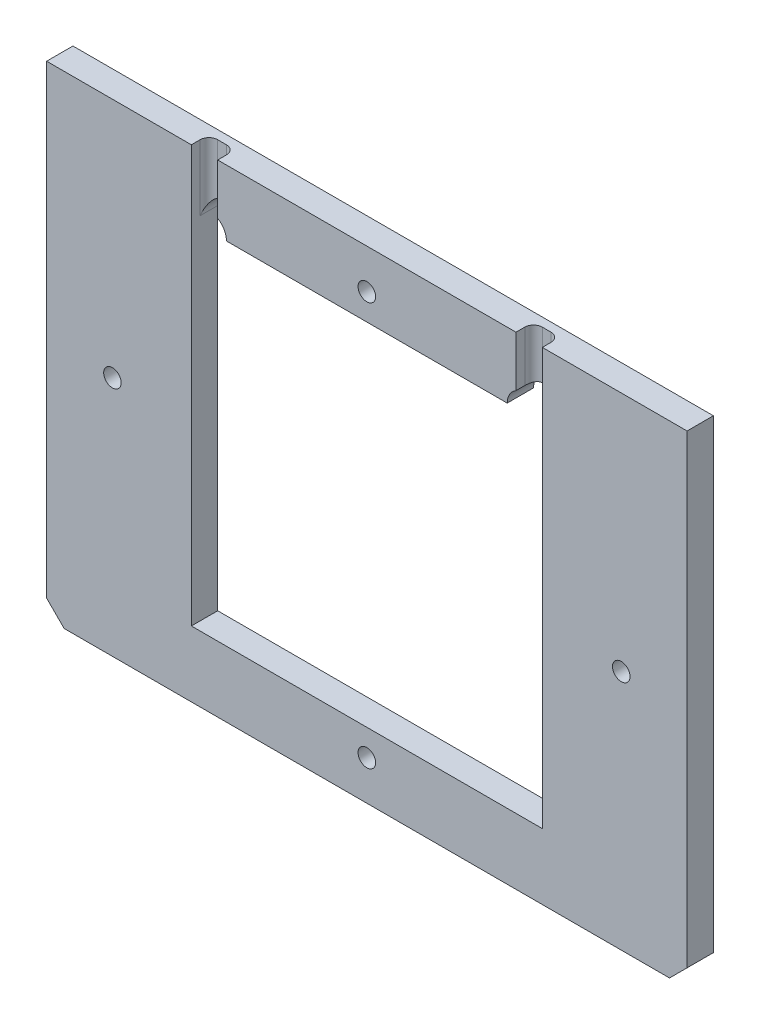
ISO-10303-21;
HEADER;
FILE_DESCRIPTION(('STEP AP214'),'2;1');
FILE_NAME('part.step','',(''),(''),'','','');
FILE_SCHEMA(('AUTOMOTIVE_DESIGN { 1 0 10303 214 1 1 1 1 }'));
ENDSEC;
DATA;
#1=APPLICATION_CONTEXT('core data for automotive mechanical design processes');
#2=APPLICATION_PROTOCOL_DEFINITION('international standard','automotive_design',2000,#1);
#3=PRODUCT_CONTEXT('',#1,'mechanical');
#4=PRODUCT('Part','Part','',(#3));
#5=PRODUCT_RELATED_PRODUCT_CATEGORY('part','',(#4));
#6=PRODUCT_DEFINITION_FORMATION('','',#4);
#7=PRODUCT_DEFINITION_CONTEXT('part definition',#1,'design');
#8=PRODUCT_DEFINITION('design','',#6,#7);
#9=PRODUCT_DEFINITION_SHAPE('','',#8);
#10=(LENGTH_UNIT() NAMED_UNIT(*) SI_UNIT(.MILLI.,.METRE.));
#11=(NAMED_UNIT(*) PLANE_ANGLE_UNIT() SI_UNIT($,.RADIAN.));
#12=(NAMED_UNIT(*) SI_UNIT($,.STERADIAN.) SOLID_ANGLE_UNIT());
#13=UNCERTAINTY_MEASURE_WITH_UNIT(LENGTH_MEASURE(1.E-05),#10,'distance_accuracy_value','');
#14=(GEOMETRIC_REPRESENTATION_CONTEXT(3) GLOBAL_UNCERTAINTY_ASSIGNED_CONTEXT((#13)) GLOBAL_UNIT_ASSIGNED_CONTEXT((#10,
#11,#12)) REPRESENTATION_CONTEXT('',''));
#15=CARTESIAN_POINT('',(0.,0.,0.));
#16=DIRECTION('',(0.,0.,1.));
#17=DIRECTION('',(1.,0.,0.));
#18=AXIS2_PLACEMENT_3D('',#15,#16,#17);
#19=CARTESIAN_POINT('',(-50.7778745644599,-21.9003484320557,0.));
#20=DIRECTION('',(0.,0.,1.));
#21=DIRECTION('',(1.,0.,0.));
#22=AXIS2_PLACEMENT_3D('',#19,#20,#21);
#23=PLANE('',#22);
#24=DIRECTION('',(0.866025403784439,0.5,0.));
#25=VECTOR('',#24,1.);
#26=CARTESIAN_POINT('',(-43.2778745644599,3.33887001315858,0.));
#27=LINE('',#26,#25);
#28=CARTESIAN_POINT('',(-43.2778745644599,3.33887001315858,0.));
#29=VERTEX_POINT('',#28);
#30=CARTESIAN_POINT('',(-41.3199803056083,4.46926079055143,0.));
#31=VERTEX_POINT('',#30);
#32=EDGE_CURVE('E283',#29,#31,#27,.T.);
#33=ORIENTED_EDGE('',*,*,#32,.T.);
#34=DIRECTION('',(0.,1.,0.));
#35=VECTOR('',#34,1.);
#36=CARTESIAN_POINT('',(-41.3199803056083,4.46926079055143,0.));
#37=LINE('',#36,#35);
#38=CARTESIAN_POINT('',(-41.3199803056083,6.7300423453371,0.));
#39=VERTEX_POINT('',#38);
#40=EDGE_CURVE('E306',#31,#39,#37,.T.);
#41=ORIENTED_EDGE('',*,*,#40,.T.);
#42=DIRECTION('',(-0.866025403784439,0.5,0.));
#43=VECTOR('',#42,1.);
#44=CARTESIAN_POINT('',(-41.3199803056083,6.7300423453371,0.));
#45=LINE('',#44,#43);
#46=CARTESIAN_POINT('',(-43.2778745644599,7.86043312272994,0.));
#47=VERTEX_POINT('',#46);
#48=EDGE_CURVE('E309',#39,#47,#45,.T.);
#49=ORIENTED_EDGE('',*,*,#48,.T.);
#50=DIRECTION('',(-0.866025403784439,-0.499999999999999,0.));
#51=VECTOR('',#50,1.);
#52=CARTESIAN_POINT('',(-43.2778745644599,7.86043312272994,0.));
#53=LINE('',#52,#51);
#54=CARTESIAN_POINT('',(-45.2357688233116,6.7300423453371,0.));
#55=VERTEX_POINT('',#54);
#56=EDGE_CURVE('E312',#47,#55,#53,.T.);
#57=ORIENTED_EDGE('',*,*,#56,.T.);
#58=DIRECTION('',(0.,-1.,0.));
#59=VECTOR('',#58,1.);
#60=CARTESIAN_POINT('',(-45.2357688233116,6.7300423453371,0.));
#61=LINE('',#60,#59);
#62=CARTESIAN_POINT('',(-45.2357688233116,4.46926079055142,0.));
#63=VERTEX_POINT('',#62);
#64=EDGE_CURVE('E315',#55,#63,#61,.T.);
#65=ORIENTED_EDGE('',*,*,#64,.T.);
#66=DIRECTION('',(0.866025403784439,-0.5,0.));
#67=VECTOR('',#66,1.);
#68=CARTESIAN_POINT('',(-45.2357688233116,4.46926079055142,0.));
#69=LINE('',#68,#67);
#70=EDGE_CURVE('E293',#63,#29,#69,.T.);
#71=ORIENTED_EDGE('',*,*,#70,.T.);
#72=EDGE_LOOP('',(#33,#41,#49,#57,#65,#71));
#73=FACE_BOUND('',#72,.T.);
#74=CARTESIAN_POINT('',(-14.2778745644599,28.5996515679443,0.));
#75=DIRECTION('',(0.,0.,1.));
#76=DIRECTION('',(1.,0.,0.));
#77=AXIS2_PLACEMENT_3D('',#74,#75,#76);
#78=CIRCLE('',#77,1.);
#79=CARTESIAN_POINT('',(-13.2778745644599,28.5996515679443,0.));
#80=VERTEX_POINT('',#79);
#81=EDGE_CURVE('E363',#80,#80,#78,.T.);
#82=ORIENTED_EDGE('',*,*,#81,.T.);
#83=EDGE_LOOP('',(#82));
#84=FACE_BOUND('',#83,.T.);
#85=DIRECTION('',(1.,0.,0.));
#86=VECTOR('',#85,1.);
#87=CARTESIAN_POINT('',(-50.7778745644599,-21.9003484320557,0.));
#88=LINE('',#87,#86);
#89=CARTESIAN_POINT('',(-48.7778745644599,-21.9003484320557,0.));
#90=VERTEX_POINT('',#89);
#91=CARTESIAN_POINT('',(20.2221254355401,-21.9003484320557,0.));
#92=VERTEX_POINT('',#91);
#93=EDGE_CURVE('E431',#90,#92,#88,.T.);
#94=ORIENTED_EDGE('',*,*,#93,.F.);
#95=DIRECTION('',(0.707106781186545,-0.70710678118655,0.));
#96=VECTOR('',#95,1.);
#97=CARTESIAN_POINT('',(-48.7778745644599,-21.9003484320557,0.));
#98=LINE('',#97,#96);
#99=CARTESIAN_POINT('',(-50.7778745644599,-19.9003484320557,0.));
#100=VERTEX_POINT('',#99);
#101=EDGE_CURVE('E552',#90,#100,#98,.F.);
#102=ORIENTED_EDGE('',*,*,#101,.T.);
#103=DIRECTION('',(0.,-1.,0.));
#104=VECTOR('',#103,1.);
#105=CARTESIAN_POINT('',(-50.7778745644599,33.0996515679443,0.));
#106=LINE('',#105,#104);
#107=CARTESIAN_POINT('',(-50.7778745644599,33.0996515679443,0.));
#108=VERTEX_POINT('',#107);
#109=EDGE_CURVE('E416',#108,#100,#106,.T.);
#110=ORIENTED_EDGE('',*,*,#109,.F.);
#111=DIRECTION('',(-1.,0.,0.));
#112=VECTOR('',#111,1.);
#113=CARTESIAN_POINT('',(-50.7778745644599,33.0996515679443,0.));
#114=LINE('',#113,#112);
#115=CARTESIAN_POINT('',(22.2221254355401,33.0996515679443,0.));
#116=VERTEX_POINT('',#115);
#117=EDGE_CURVE('E420',#116,#108,#114,.T.);
#118=ORIENTED_EDGE('',*,*,#117,.F.);
#119=DIRECTION('',(0.,1.,0.));
#120=VECTOR('',#119,1.);
#121=CARTESIAN_POINT('',(22.2221254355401,33.0996515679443,0.));
#122=LINE('',#121,#120);
#123=CARTESIAN_POINT('',(22.2221254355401,-19.9003484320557,0.));
#124=VERTEX_POINT('',#123);
#125=EDGE_CURVE('E434',#124,#116,#122,.T.);
#126=ORIENTED_EDGE('',*,*,#125,.F.);
#127=DIRECTION('',(0.70710678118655,0.707106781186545,0.));
#128=VECTOR('',#127,1.);
#129=CARTESIAN_POINT('',(22.2221254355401,-19.9003484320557,0.));
#130=LINE('',#129,#128);
#131=EDGE_CURVE('E550',#124,#92,#130,.F.);
#132=ORIENTED_EDGE('',*,*,#131,.T.);
#133=EDGE_LOOP('',(#94,#102,#110,#118,#126,#132));
#134=FACE_BOUND('',#133,.T.);
#135=CARTESIAN_POINT('',(-32.2778745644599,25.5996515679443,0.));
#136=DIRECTION('',(0.,0.,1.));
#137=DIRECTION('',(-1.,0.,0.));
#138=AXIS2_PLACEMENT_3D('',#135,#136,#137);
#139=CIRCLE('',#138,2.00000000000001);
#140=CARTESIAN_POINT('',(-30.2778745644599,25.5996515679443,0.));
#141=VERTEX_POINT('',#140);
#142=CARTESIAN_POINT('',(-34.2778745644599,25.5996515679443,0.));
#143=VERTEX_POINT('',#142);
#144=EDGE_CURVE('E369',#141,#143,#139,.T.);
#145=ORIENTED_EDGE('',*,*,#144,.T.);
#146=DIRECTION('',(0.,-1.,0.));
#147=VECTOR('',#146,1.);
#148=CARTESIAN_POINT('',(-34.2778745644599,25.5996515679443,0.));
#149=LINE('',#148,#147);
#150=CARTESIAN_POINT('',(-34.2778745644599,-14.4003484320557,0.));
#151=VERTEX_POINT('',#150);
#152=EDGE_CURVE('E390',#143,#151,#149,.T.);
#153=ORIENTED_EDGE('',*,*,#152,.T.);
#154=DIRECTION('',(1.,0.,0.));
#155=VECTOR('',#154,1.);
#156=CARTESIAN_POINT('',(-34.2778745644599,-14.4003484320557,0.));
#157=LINE('',#156,#155);
#158=CARTESIAN_POINT('',(5.72212543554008,-14.4003484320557,0.));
#159=VERTEX_POINT('',#158);
#160=EDGE_CURVE('E393',#151,#159,#157,.T.);
#161=ORIENTED_EDGE('',*,*,#160,.T.);
#162=DIRECTION('',(0.,1.,0.));
#163=VECTOR('',#162,1.);
#164=CARTESIAN_POINT('',(5.72212543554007,25.5996515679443,0.));
#165=LINE('',#164,#163);
#166=CARTESIAN_POINT('',(5.72212543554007,25.5996515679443,0.));
#167=VERTEX_POINT('',#166);
#168=EDGE_CURVE('E396',#159,#167,#165,.T.);
#169=ORIENTED_EDGE('',*,*,#168,.T.);
#170=CARTESIAN_POINT('',(3.72212543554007,25.5996515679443,0.));
#171=DIRECTION('',(0.,0.,1.));
#172=DIRECTION('',(-1.,0.,0.));
#173=AXIS2_PLACEMENT_3D('',#170,#171,#172);
#174=CIRCLE('',#173,2.);
#175=CARTESIAN_POINT('',(1.72212543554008,25.5996515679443,0.));
#176=VERTEX_POINT('',#175);
#177=EDGE_CURVE('E399',#167,#176,#174,.T.);
#178=ORIENTED_EDGE('',*,*,#177,.T.);
#179=DIRECTION('',(-1.,0.,0.));
#180=VECTOR('',#179,1.);
#181=CARTESIAN_POINT('',(-30.2778745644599,25.5996515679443,0.));
#182=LINE('',#181,#180);
#183=EDGE_CURVE('E376',#176,#141,#182,.T.);
#184=ORIENTED_EDGE('',*,*,#183,.T.);
#185=EDGE_LOOP('',(#145,#153,#161,#169,#178,#184));
#186=FACE_BOUND('',#185,.T.);
#187=CARTESIAN_POINT('',(-14.2778745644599,-17.4003484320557,0.));
#188=DIRECTION('',(0.,0.,1.));
#189=DIRECTION('',(1.,0.,0.));
#190=AXIS2_PLACEMENT_3D('',#187,#188,#189);
#191=CIRCLE('',#190,1.);
#192=CARTESIAN_POINT('',(-13.2778745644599,-17.4003484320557,0.));
#193=VERTEX_POINT('',#192);
#194=EDGE_CURVE('E358',#193,#193,#191,.T.);
#195=ORIENTED_EDGE('',*,*,#194,.T.);
#196=EDGE_LOOP('',(#195));
#197=FACE_BOUND('',#196,.T.);
#198=DIRECTION('',(0.5,0.866025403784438,0.));
#199=VECTOR('',#198,1.);
#200=CARTESIAN_POINT('',(15.8768259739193,3.59965156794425,0.));
#201=LINE('',#200,#199);
#202=CARTESIAN_POINT('',(15.8768259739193,3.59965156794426,0.));
#203=VERTEX_POINT('',#202);
#204=CARTESIAN_POINT('',(17.0315265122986,5.59965156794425,0.));
#205=VERTEX_POINT('',#204);
#206=EDGE_CURVE('E973',#203,#205,#201,.T.);
#207=ORIENTED_EDGE('',*,*,#206,.T.);
#208=DIRECTION('',(-0.5,0.866025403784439,0.));
#209=VECTOR('',#208,1.);
#210=CARTESIAN_POINT('',(17.0315265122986,5.59965156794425,0.));
#211=LINE('',#210,#209);
#212=CARTESIAN_POINT('',(15.8768259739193,7.59965156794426,0.));
#213=VERTEX_POINT('',#212);
#214=EDGE_CURVE('E278',#205,#213,#211,.T.);
#215=ORIENTED_EDGE('',*,*,#214,.T.);
#216=DIRECTION('',(-1.,0.,0.));
#217=VECTOR('',#216,1.);
#218=CARTESIAN_POINT('',(15.8768259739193,7.59965156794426,0.));
#219=LINE('',#218,#217);
#220=CARTESIAN_POINT('',(13.5674248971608,7.59965156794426,0.));
#221=VERTEX_POINT('',#220);
#222=EDGE_CURVE('E978',#213,#221,#219,.T.);
#223=ORIENTED_EDGE('',*,*,#222,.T.);
#224=DIRECTION('',(-0.499999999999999,-0.866025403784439,0.));
#225=VECTOR('',#224,1.);
#226=CARTESIAN_POINT('',(13.5674248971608,7.59965156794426,0.));
#227=LINE('',#226,#225);
#228=CARTESIAN_POINT('',(12.4127243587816,5.59965156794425,0.));
#229=VERTEX_POINT('',#228);
#230=EDGE_CURVE('E985',#221,#229,#227,.T.);
#231=ORIENTED_EDGE('',*,*,#230,.T.);
#232=DIRECTION('',(0.5,-0.866025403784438,0.));
#233=VECTOR('',#232,1.);
#234=CARTESIAN_POINT('',(12.4127243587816,5.59965156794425,0.));
#235=LINE('',#234,#233);
#236=CARTESIAN_POINT('',(13.5674248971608,3.59965156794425,0.));
#237=VERTEX_POINT('',#236);
#238=EDGE_CURVE('E988',#229,#237,#235,.T.);
#239=ORIENTED_EDGE('',*,*,#238,.T.);
#240=DIRECTION('',(1.,0.,0.));
#241=VECTOR('',#240,1.);
#242=CARTESIAN_POINT('',(13.5674248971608,3.59965156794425,0.));
#243=LINE('',#242,#241);
#244=EDGE_CURVE('E274',#237,#203,#243,.T.);
#245=ORIENTED_EDGE('',*,*,#244,.T.);
#246=EDGE_LOOP('',(#207,#215,#223,#231,#239,#245));
#247=FACE_BOUND('',#246,.T.);
#248=ADVANCED_FACE('F31',(#73,#84,#134,#186,#197,#247),#23,.F.);
#249=CARTESIAN_POINT('',(14.7221254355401,5.59965156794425,3.));
#250=DIRECTION('',(0.,0.,-1.));
#251=DIRECTION('',(-1.,0.,0.));
#252=AXIS2_PLACEMENT_3D('',#249,#250,#251);
#253=CYLINDRICAL_SURFACE('',#252,1.);
#254=CARTESIAN_POINT('',(14.7221254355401,5.59965156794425,3.));
#255=DIRECTION('',(0.,0.,1.));
#256=DIRECTION('',(1.,0.,0.));
#257=AXIS2_PLACEMENT_3D('',#254,#255,#256);
#258=CIRCLE('',#257,1.);
#259=CARTESIAN_POINT('',(15.7221254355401,5.59965156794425,3.));
#260=VERTEX_POINT('',#259);
#261=EDGE_CURVE('E334',#260,#260,#258,.T.);
#262=ORIENTED_EDGE('',*,*,#261,.T.);
#263=EDGE_LOOP('',(#262));
#264=FACE_BOUND('',#263,.T.);
#265=CARTESIAN_POINT('',(14.7221254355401,5.59965156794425,1.5));
#266=DIRECTION('',(0.,0.,-1.));
#267=DIRECTION('',(-1.,0.,0.));
#268=AXIS2_PLACEMENT_3D('',#265,#266,#267);
#269=CIRCLE('',#268,1.);
#270=CARTESIAN_POINT('',(13.7221254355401,5.59965156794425,1.5));
#271=VERTEX_POINT('',#270);
#272=EDGE_CURVE('E279',#271,#271,#269,.T.);
#273=ORIENTED_EDGE('',*,*,#272,.T.);
#274=EDGE_LOOP('',(#273));
#275=FACE_BOUND('',#274,.T.);
#276=ADVANCED_FACE('F586',(#264,#275),#253,.F.);
#277=CARTESIAN_POINT('',(-50.7778745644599,-21.9003484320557,3.));
#278=DIRECTION('',(0.,0.,1.));
#279=DIRECTION('',(1.,0.,0.));
#280=AXIS2_PLACEMENT_3D('',#277,#278,#279);
#281=PLANE('',#280);
#282=CARTESIAN_POINT('',(-43.2778745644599,5.59965156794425,3.));
#283=DIRECTION('',(0.,0.,1.));
#284=DIRECTION('',(1.,0.,0.));
#285=AXIS2_PLACEMENT_3D('',#282,#283,#284);
#286=CIRCLE('',#285,0.999999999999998);
#287=CARTESIAN_POINT('',(-42.2778745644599,5.59965156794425,3.));
#288=VERTEX_POINT('',#287);
#289=EDGE_CURVE('E337',#288,#288,#286,.T.);
#290=ORIENTED_EDGE('',*,*,#289,.F.);
#291=EDGE_LOOP('',(#290));
#292=FACE_BOUND('',#291,.T.);
#293=DIRECTION('',(0.,-1.,0.));
#294=VECTOR('',#293,1.);
#295=CARTESIAN_POINT('',(-50.7778745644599,33.0996515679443,3.));
#296=LINE('',#295,#294);
#297=CARTESIAN_POINT('',(-50.7778745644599,33.0996515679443,3.));
#298=VERTEX_POINT('',#297);
#299=CARTESIAN_POINT('',(-50.7778745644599,-19.9003484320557,3.));
#300=VERTEX_POINT('',#299);
#301=EDGE_CURVE('E417',#298,#300,#296,.T.);
#302=ORIENTED_EDGE('',*,*,#301,.T.);
#303=DIRECTION('',(-0.707106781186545,0.70710678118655,0.));
#304=VECTOR('',#303,1.);
#305=CARTESIAN_POINT('',(-49.7778745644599,-20.9003484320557,3.));
#306=LINE('',#305,#304);
#307=CARTESIAN_POINT('',(-48.7778745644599,-21.9003484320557,3.));
#308=VERTEX_POINT('',#307);
#309=EDGE_CURVE('E39',#300,#308,#306,.F.);
#310=ORIENTED_EDGE('',*,*,#309,.T.);
#311=DIRECTION('',(1.,0.,0.));
#312=VECTOR('',#311,1.);
#313=CARTESIAN_POINT('',(-50.7778745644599,-21.9003484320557,3.));
#314=LINE('',#313,#312);
#315=CARTESIAN_POINT('',(20.22212543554,-21.9003484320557,3.));
#316=VERTEX_POINT('',#315);
#317=EDGE_CURVE('E419',#308,#316,#314,.T.);
#318=ORIENTED_EDGE('',*,*,#317,.T.);
#319=DIRECTION('',(-0.70710678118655,-0.707106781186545,0.));
#320=VECTOR('',#319,1.);
#321=CARTESIAN_POINT('',(-15.2778745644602,-57.4003484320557,3.));
#322=LINE('',#321,#320);
#323=CARTESIAN_POINT('',(22.2221254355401,-19.9003484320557,3.));
#324=VERTEX_POINT('',#323);
#325=EDGE_CURVE('E46',#316,#324,#322,.F.);
#326=ORIENTED_EDGE('',*,*,#325,.T.);
#327=DIRECTION('',(0.,1.,0.));
#328=VECTOR('',#327,1.);
#329=CARTESIAN_POINT('',(22.2221254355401,33.0996515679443,3.));
#330=LINE('',#329,#328);
#331=CARTESIAN_POINT('',(22.2221254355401,33.0996515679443,3.));
#332=VERTEX_POINT('',#331);
#333=EDGE_CURVE('E422',#324,#332,#330,.T.);
#334=ORIENTED_EDGE('',*,*,#333,.T.);
#335=DIRECTION('',(-1.,0.,0.));
#336=VECTOR('',#335,1.);
#337=CARTESIAN_POINT('',(-50.7778745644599,33.0996515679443,3.));
#338=LINE('',#337,#336);
#339=CARTESIAN_POINT('',(5.72212543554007,33.0996515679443,3.));
#340=VERTEX_POINT('',#339);
#341=EDGE_CURVE('E425',#332,#340,#338,.T.);
#342=ORIENTED_EDGE('',*,*,#341,.T.);
#343=DIRECTION('',(0.,1.,0.));
#344=VECTOR('',#343,1.);
#345=CARTESIAN_POINT('',(5.72212543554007,25.5996515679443,3.));
#346=LINE('',#345,#344);
#347=CARTESIAN_POINT('',(5.72212543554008,-14.4003484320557,3.));
#348=VERTEX_POINT('',#347);
#349=EDGE_CURVE('E380',#348,#340,#346,.T.);
#350=ORIENTED_EDGE('',*,*,#349,.F.);
#351=DIRECTION('',(1.,0.,0.));
#352=VECTOR('',#351,1.);
#353=CARTESIAN_POINT('',(-34.2778745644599,-14.4003484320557,3.));
#354=LINE('',#353,#352);
#355=CARTESIAN_POINT('',(-34.2778745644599,-14.4003484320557,3.));
#356=VERTEX_POINT('',#355);
#357=EDGE_CURVE('E378',#356,#348,#354,.T.);
#358=ORIENTED_EDGE('',*,*,#357,.F.);
#359=DIRECTION('',(0.,-1.,0.));
#360=VECTOR('',#359,1.);
#361=CARTESIAN_POINT('',(-34.2778745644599,25.5996515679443,3.));
#362=LINE('',#361,#360);
#363=CARTESIAN_POINT('',(-34.2778745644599,33.0996515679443,3.));
#364=VERTEX_POINT('',#363);
#365=EDGE_CURVE('E375',#364,#356,#362,.T.);
#366=ORIENTED_EDGE('',*,*,#365,.F.);
#367=EDGE_CURVE('E424',#364,#298,#338,.T.);
#368=ORIENTED_EDGE('',*,*,#367,.T.);
#369=EDGE_LOOP('',(#302,#310,#318,#326,#334,#342,#350,#358,#366,#368));
#370=FACE_BOUND('',#369,.T.);
#371=CARTESIAN_POINT('',(-14.2778745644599,-17.4003484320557,3.));
#372=DIRECTION('',(0.,0.,1.));
#373=DIRECTION('',(1.,0.,0.));
#374=AXIS2_PLACEMENT_3D('',#371,#372,#373);
#375=CIRCLE('',#374,1.);
#376=CARTESIAN_POINT('',(-13.2778745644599,-17.4003484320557,3.));
#377=VERTEX_POINT('',#376);
#378=EDGE_CURVE('E360',#377,#377,#375,.T.);
#379=ORIENTED_EDGE('',*,*,#378,.F.);
#380=EDGE_LOOP('',(#379));
#381=FACE_BOUND('',#380,.T.);
#382=ORIENTED_EDGE('',*,*,#261,.F.);
#383=EDGE_LOOP('',(#382));
#384=FACE_BOUND('',#383,.T.);
#385=ADVANCED_FACE('F533',(#292,#370,#381,#384),#281,.T.);
#386=DIRECTION('',(0.,-1.,0.));
#387=VECTOR('',#386,1.);
#388=CARTESIAN_POINT('',(2.72212543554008,33.0996515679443,3.));
#389=LINE('',#388,#387);
#390=CARTESIAN_POINT('',(2.72212543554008,33.0996515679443,3.));
#391=VERTEX_POINT('',#390);
#392=CARTESIAN_POINT('',(2.72212543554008,27.3317023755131,3.));
#393=VERTEX_POINT('',#392);
#394=EDGE_CURVE('E340',#391,#393,#389,.T.);
#395=ORIENTED_EDGE('',*,*,#394,.F.);
#396=CARTESIAN_POINT('',(-31.2778745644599,33.0996515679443,3.));
#397=VERTEX_POINT('',#396);
#398=EDGE_CURVE('E429',#391,#397,#338,.T.);
#399=ORIENTED_EDGE('',*,*,#398,.T.);
#400=DIRECTION('',(0.,1.,0.));
#401=VECTOR('',#400,1.);
#402=CARTESIAN_POINT('',(-31.2778745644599,25.5996515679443,3.));
#403=LINE('',#402,#401);
#404=CARTESIAN_POINT('',(-31.2778745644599,27.3317023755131,3.));
#405=VERTEX_POINT('',#404);
#406=EDGE_CURVE('E348',#405,#397,#403,.T.);
#407=ORIENTED_EDGE('',*,*,#406,.F.);
#408=CARTESIAN_POINT('',(-32.2778745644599,25.5996515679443,3.));
#409=DIRECTION('',(0.,0.,1.));
#410=DIRECTION('',(-1.,0.,0.));
#411=AXIS2_PLACEMENT_3D('',#408,#409,#410);
#412=CIRCLE('',#411,2.00000000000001);
#413=CARTESIAN_POINT('',(-30.2778745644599,25.5996515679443,3.));
#414=VERTEX_POINT('',#413);
#415=EDGE_CURVE('E372',#414,#405,#412,.T.);
#416=ORIENTED_EDGE('',*,*,#415,.F.);
#417=DIRECTION('',(-1.,0.,0.));
#418=VECTOR('',#417,1.);
#419=CARTESIAN_POINT('',(-30.2778745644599,25.5996515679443,3.));
#420=LINE('',#419,#418);
#421=CARTESIAN_POINT('',(1.72212543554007,25.5996515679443,3.));
#422=VERTEX_POINT('',#421);
#423=EDGE_CURVE('E385',#422,#414,#420,.T.);
#424=ORIENTED_EDGE('',*,*,#423,.F.);
#425=CARTESIAN_POINT('',(3.72212543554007,25.5996515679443,3.));
#426=DIRECTION('',(0.,0.,1.));
#427=DIRECTION('',(-1.,0.,0.));
#428=AXIS2_PLACEMENT_3D('',#425,#426,#427);
#429=CIRCLE('',#428,2.);
#430=EDGE_CURVE('E383',#393,#422,#429,.T.);
#431=ORIENTED_EDGE('',*,*,#430,.F.);
#432=EDGE_LOOP('',(#395,#399,#407,#416,#424,#431));
#433=FACE_BOUND('',#432,.T.);
#434=CARTESIAN_POINT('',(-14.2778745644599,28.5996515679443,3.));
#435=DIRECTION('',(0.,0.,1.));
#436=DIRECTION('',(1.,0.,0.));
#437=AXIS2_PLACEMENT_3D('',#434,#435,#436);
#438=CIRCLE('',#437,1.);
#439=CARTESIAN_POINT('',(-13.2778745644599,28.5996515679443,3.));
#440=VERTEX_POINT('',#439);
#441=EDGE_CURVE('E366',#440,#440,#438,.T.);
#442=ORIENTED_EDGE('',*,*,#441,.F.);
#443=EDGE_LOOP('',(#442));
#444=FACE_BOUND('',#443,.T.);
#445=ADVANCED_FACE('F602',(#433,#444),#281,.T.);
#446=CARTESIAN_POINT('',(-50.7778745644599,33.0996515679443,3.));
#447=DIRECTION('',(1.,0.,0.));
#448=DIRECTION('',(0.,0.,-1.));
#449=AXIS2_PLACEMENT_3D('',#446,#447,#448);
#450=PLANE('',#449);
#451=ORIENTED_EDGE('',*,*,#109,.T.);
#452=DIRECTION('',(0.,0.,1.));
#453=VECTOR('',#452,1.);
#454=CARTESIAN_POINT('',(-50.7778745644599,-19.9003484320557,3.));
#455=LINE('',#454,#453);
#456=EDGE_CURVE('E54',#100,#300,#455,.T.);
#457=ORIENTED_EDGE('',*,*,#456,.T.);
#458=ORIENTED_EDGE('',*,*,#301,.F.);
#459=DIRECTION('',(0.,0.,-1.));
#460=VECTOR('',#459,1.);
#461=CARTESIAN_POINT('',(-50.7778745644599,33.0996515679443,3.));
#462=LINE('',#461,#460);
#463=EDGE_CURVE('E428',#298,#108,#462,.T.);
#464=ORIENTED_EDGE('',*,*,#463,.T.);
#465=EDGE_LOOP('',(#451,#457,#458,#464));
#466=FACE_BOUND('',#465,.T.);
#467=ADVANCED_FACE('F500',(#466),#450,.F.);
#468=CARTESIAN_POINT('',(-50.7778745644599,-21.9003484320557,3.));
#469=DIRECTION('',(0.,1.,0.));
#470=DIRECTION('',(0.,0.,1.));
#471=AXIS2_PLACEMENT_3D('',#468,#469,#470);
#472=PLANE('',#471);
#473=ORIENTED_EDGE('',*,*,#317,.F.);
#474=DIRECTION('',(0.,0.,-1.));
#475=VECTOR('',#474,1.);
#476=CARTESIAN_POINT('',(-48.7778745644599,-21.9003484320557,3.));
#477=LINE('',#476,#475);
#478=EDGE_CURVE('E547',#308,#90,#477,.T.);
#479=ORIENTED_EDGE('',*,*,#478,.T.);
#480=ORIENTED_EDGE('',*,*,#93,.T.);
#481=DIRECTION('',(0.,0.,1.));
#482=VECTOR('',#481,1.);
#483=CARTESIAN_POINT('',(20.2221254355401,-21.9003484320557,3.));
#484=LINE('',#483,#482);
#485=EDGE_CURVE('E542',#92,#316,#484,.T.);
#486=ORIENTED_EDGE('',*,*,#485,.T.);
#487=EDGE_LOOP('',(#473,#479,#480,#486));
#488=FACE_BOUND('',#487,.T.);
#489=ADVANCED_FACE('F561',(#488),#472,.F.);
#490=CARTESIAN_POINT('',(22.2221254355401,33.0996515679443,3.));
#491=DIRECTION('',(-1.,0.,0.));
#492=DIRECTION('',(0.,-1.,0.));
#493=AXIS2_PLACEMENT_3D('',#490,#491,#492);
#494=PLANE('',#493);
#495=ORIENTED_EDGE('',*,*,#333,.F.);
#496=DIRECTION('',(0.,0.,-1.));
#497=VECTOR('',#496,1.);
#498=CARTESIAN_POINT('',(22.2221254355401,-19.9003484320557,3.));
#499=LINE('',#498,#497);
#500=EDGE_CURVE('E11',#324,#124,#499,.T.);
#501=ORIENTED_EDGE('',*,*,#500,.T.);
#502=ORIENTED_EDGE('',*,*,#125,.T.);
#503=DIRECTION('',(0.,0.,-1.));
#504=VECTOR('',#503,1.);
#505=CARTESIAN_POINT('',(22.2221254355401,33.0996515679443,3.));
#506=LINE('',#505,#504);
#507=EDGE_CURVE('E439',#332,#116,#506,.T.);
#508=ORIENTED_EDGE('',*,*,#507,.F.);
#509=EDGE_LOOP('',(#495,#501,#502,#508));
#510=FACE_BOUND('',#509,.T.);
#511=ADVANCED_FACE('F578',(#510),#494,.F.);
#512=CARTESIAN_POINT('',(-50.7778745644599,33.0996515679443,3.));
#513=DIRECTION('',(0.,-1.,0.));
#514=DIRECTION('',(0.,0.,-1.));
#515=AXIS2_PLACEMENT_3D('',#512,#513,#514);
#516=PLANE('',#515);
#517=ORIENTED_EDGE('',*,*,#398,.F.);
#518=DIRECTION('',(0.,0.,1.));
#519=VECTOR('',#518,1.);
#520=CARTESIAN_POINT('',(2.72212543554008,33.0996515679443,1.));
#521=LINE('',#520,#519);
#522=CARTESIAN_POINT('',(2.72212543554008,33.0996515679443,2.));
#523=VERTEX_POINT('',#522);
#524=EDGE_CURVE('E346',#523,#391,#521,.T.);
#525=ORIENTED_EDGE('',*,*,#524,.F.);
#526=CARTESIAN_POINT('',(3.72212543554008,33.0996515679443,2.));
#527=DIRECTION('',(0.,-1.,0.));
#528=DIRECTION('',(0.,0.,-1.));
#529=AXIS2_PLACEMENT_3D('',#526,#527,#528);
#530=CIRCLE('',#529,1.);
#531=CARTESIAN_POINT('',(3.72212543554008,33.0996515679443,1.));
#532=VERTEX_POINT('',#531);
#533=EDGE_CURVE('E522',#523,#532,#530,.T.);
#534=ORIENTED_EDGE('',*,*,#533,.T.);
#535=DIRECTION('',(-1.,0.,0.));
#536=VECTOR('',#535,1.);
#537=CARTESIAN_POINT('',(5.72212543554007,33.0996515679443,1.));
#538=LINE('',#537,#536);
#539=CARTESIAN_POINT('',(4.72212543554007,33.0996515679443,1.));
#540=VERTEX_POINT('',#539);
#541=EDGE_CURVE('E341',#540,#532,#538,.T.);
#542=ORIENTED_EDGE('',*,*,#541,.F.);
#543=CARTESIAN_POINT('',(4.72212543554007,33.0996515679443,2.));
#544=DIRECTION('',(0.,-1.,0.));
#545=DIRECTION('',(0.,0.,-1.));
#546=AXIS2_PLACEMENT_3D('',#543,#544,#545);
#547=CIRCLE('',#546,1.);
#548=CARTESIAN_POINT('',(5.72212543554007,33.0996515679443,2.));
#549=VERTEX_POINT('',#548);
#550=EDGE_CURVE('E474',#540,#549,#547,.T.);
#551=ORIENTED_EDGE('',*,*,#550,.T.);
#552=DIRECTION('',(0.,0.,1.));
#553=VECTOR('',#552,1.);
#554=CARTESIAN_POINT('',(5.72212543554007,33.0996515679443,1.));
#555=LINE('',#554,#553);
#556=EDGE_CURVE('E344',#549,#340,#555,.T.);
#557=ORIENTED_EDGE('',*,*,#556,.T.);
#558=ORIENTED_EDGE('',*,*,#341,.F.);
#559=ORIENTED_EDGE('',*,*,#507,.T.);
#560=ORIENTED_EDGE('',*,*,#117,.T.);
#561=ORIENTED_EDGE('',*,*,#463,.F.);
#562=ORIENTED_EDGE('',*,*,#367,.F.);
#563=DIRECTION('',(0.,0.,1.));
#564=VECTOR('',#563,1.);
#565=CARTESIAN_POINT('',(-34.2778745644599,33.0996515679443,1.));
#566=LINE('',#565,#564);
#567=CARTESIAN_POINT('',(-34.2778745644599,33.0996515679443,2.));
#568=VERTEX_POINT('',#567);
#569=EDGE_CURVE('E356',#568,#364,#566,.T.);
#570=ORIENTED_EDGE('',*,*,#569,.F.);
#571=CARTESIAN_POINT('',(-33.2778745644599,33.0996515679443,2.));
#572=DIRECTION('',(0.,-1.,0.));
#573=DIRECTION('',(0.,0.,-1.));
#574=AXIS2_PLACEMENT_3D('',#571,#572,#573);
#575=CIRCLE('',#574,1.);
#576=CARTESIAN_POINT('',(-33.2778745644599,33.0996515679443,1.));
#577=VERTEX_POINT('',#576);
#578=EDGE_CURVE('E521',#568,#577,#575,.T.);
#579=ORIENTED_EDGE('',*,*,#578,.T.);
#580=DIRECTION('',(-1.,0.,0.));
#581=VECTOR('',#580,1.);
#582=CARTESIAN_POINT('',(-31.2778745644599,33.0996515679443,1.));
#583=LINE('',#582,#581);
#584=CARTESIAN_POINT('',(-32.2778745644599,33.0996515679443,1.));
#585=VERTEX_POINT('',#584);
#586=EDGE_CURVE('E350',#585,#577,#583,.T.);
#587=ORIENTED_EDGE('',*,*,#586,.F.);
#588=CARTESIAN_POINT('',(-32.2778745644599,33.0996515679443,2.));
#589=DIRECTION('',(0.,-1.,0.));
#590=DIRECTION('',(0.,0.,-1.));
#591=AXIS2_PLACEMENT_3D('',#588,#589,#590);
#592=CIRCLE('',#591,1.);
#593=CARTESIAN_POINT('',(-31.2778745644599,33.0996515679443,2.));
#594=VERTEX_POINT('',#593);
#595=EDGE_CURVE('E543',#585,#594,#592,.T.);
#596=ORIENTED_EDGE('',*,*,#595,.T.);
#597=DIRECTION('',(0.,0.,1.));
#598=VECTOR('',#597,1.);
#599=CARTESIAN_POINT('',(-31.2778745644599,33.0996515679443,1.));
#600=LINE('',#599,#598);
#601=EDGE_CURVE('E353',#594,#397,#600,.T.);
#602=ORIENTED_EDGE('',*,*,#601,.T.);
#603=EDGE_LOOP('',(#517,#525,#534,#542,#551,#557,#558,#559,#560,#561,#562,#570,#579,#587,#596,#602));
#604=FACE_BOUND('',#603,.T.);
#605=ADVANCED_FACE('F530',(#604),#516,.F.);
#606=CARTESIAN_POINT('',(-32.2778745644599,25.5996515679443,3.));
#607=DIRECTION('',(0.,0.,-1.));
#608=DIRECTION('',(-1.,0.,0.));
#609=AXIS2_PLACEMENT_3D('',#606,#607,#608);
#610=CYLINDRICAL_SURFACE('',#609,2.00000000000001);
#611=DIRECTION('',(0.,0.,-1.));
#612=VECTOR('',#611,1.);
#613=CARTESIAN_POINT('',(-31.2778745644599,27.3317023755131,3.));
#614=LINE('',#613,#612);
#615=CARTESIAN_POINT('',(-31.2778745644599,27.3317023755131,2.));
#616=VERTEX_POINT('',#615);
#617=EDGE_CURVE('E445',#616,#405,#614,.F.);
#618=ORIENTED_EDGE('',*,*,#617,.F.);
#619=CARTESIAN_POINT('',(-31.2778745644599,27.3317023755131,2.));
#620=CARTESIAN_POINT('',(-31.2778726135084,27.3316971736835,1.97380285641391));
#621=CARTESIAN_POINT('',(-31.2789046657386,27.3322974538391,1.94762059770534));
#622=CARTESIAN_POINT('',(-31.2830079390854,27.3346584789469,1.89548480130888));
#623=CARTESIAN_POINT('',(-31.2860779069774,27.3364185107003,1.86953113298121));
#624=CARTESIAN_POINT('',(-31.29824904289,27.3433328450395,1.79260627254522));
#625=CARTESIAN_POINT('',(-31.3103123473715,27.3501227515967,1.74221712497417));
#626=CARTESIAN_POINT('',(-31.3417624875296,27.367137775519,1.64457478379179));
#627=CARTESIAN_POINT('',(-31.3611345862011,27.3773559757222,1.59731550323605));
#628=CARTESIAN_POINT('',(-31.4065667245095,27.4000590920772,1.50664598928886));
#629=CARTESIAN_POINT('',(-31.4326374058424,27.4125476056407,1.46324202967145));
#630=CARTESIAN_POINT('',(-31.4932109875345,27.4396215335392,1.37768910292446));
#631=CARTESIAN_POINT('',(-31.5282289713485,27.4542949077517,1.33593276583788));
#632=CARTESIAN_POINT('',(-31.6046288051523,27.4833742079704,1.25858503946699));
#633=CARTESIAN_POINT('',(-31.6460126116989,27.497780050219,1.22299555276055));
#634=CARTESIAN_POINT('',(-31.7374059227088,27.5258727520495,1.15661730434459));
#635=CARTESIAN_POINT('',(-31.7878106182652,27.5394441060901,1.12631956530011));
#636=CARTESIAN_POINT('',(-31.8937724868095,27.5631696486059,1.07483808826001));
#637=CARTESIAN_POINT('',(-31.9493215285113,27.5733291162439,1.05364025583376));
#638=CARTESIAN_POINT('',(-32.050371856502,27.5871596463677,1.02516217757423));
#639=CARTESIAN_POINT('',(-32.0951562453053,27.5917955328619,1.01577939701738));
#640=CARTESIAN_POINT('',(-32.1858994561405,27.598064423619,1.0031745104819));
#641=CARTESIAN_POINT('',(-32.2318609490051,27.5996898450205,0.999967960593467));
#642=CARTESIAN_POINT('',(-32.2778745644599,27.5996515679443,1.));
#643=B_SPLINE_CURVE_WITH_KNOTS('',3,(#619,#620,#621,#622,#623,#624,#625,#626,#627,#628,#629,
#630,#631,#632,#633,#634,#635,#636,#637,#638,#639,#640,#641,#642),.UNSPECIFIED.,.F.,.F.,(4,2,2,
2,2,2,2,2,2,2,2,4),(0.,0.0785359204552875,0.157023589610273,0.31295187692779,0.468567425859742,
0.624431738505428,0.793037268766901,0.961694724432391,1.14182101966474,1.32166730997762,
1.45913325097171,1.59694497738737),.UNSPECIFIED.);
#644=CARTESIAN_POINT('',(-32.2778745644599,27.5996515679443,1.));
#645=VERTEX_POINT('',#644);
#646=EDGE_CURVE('E537',#616,#645,#643,.T.);
#647=ORIENTED_EDGE('',*,*,#646,.T.);
#648=CARTESIAN_POINT('',(-32.2778745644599,25.5996515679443,1.));
#649=DIRECTION('',(0.,0.,1.));
#650=DIRECTION('',(1.,0.,0.));
#651=AXIS2_PLACEMENT_3D('',#648,#649,#650);
#652=CIRCLE('',#651,2.00000000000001);
#653=CARTESIAN_POINT('',(-33.2778745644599,27.3317023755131,1.));
#654=VERTEX_POINT('',#653);
#655=EDGE_CURVE('E442',#645,#654,#652,.T.);
#656=ORIENTED_EDGE('',*,*,#655,.T.);
#657=CARTESIAN_POINT('',(-33.2778745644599,27.3317023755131,1.));
#658=CARTESIAN_POINT('',(-33.3153341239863,27.3100903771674,0.999999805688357));
#659=CARTESIAN_POINT('',(-33.3520353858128,27.2872666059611,1.00210319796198));
#660=CARTESIAN_POINT('',(-33.4235310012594,27.239559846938,1.01001340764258));
#661=CARTESIAN_POINT('',(-33.4583299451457,27.2146822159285,1.0158108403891));
#662=CARTESIAN_POINT('',(-33.525376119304,27.1634611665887,1.03051235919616));
#663=CARTESIAN_POINT('',(-33.5576510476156,27.1371415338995,1.03937426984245));
#664=CARTESIAN_POINT('',(-33.6200348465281,27.0829971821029,1.0597852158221));
#665=CARTESIAN_POINT('',(-33.6501420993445,27.05517136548,1.07133623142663));
#666=CARTESIAN_POINT('',(-33.7480726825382,26.9590047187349,1.11423276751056));
#667=CARTESIAN_POINT('',(-33.8107001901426,26.8876709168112,1.15092150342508));
#668=CARTESIAN_POINT('',(-33.923563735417,26.7400153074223,1.23318766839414));
#669=CARTESIAN_POINT('',(-33.973722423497,26.663665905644,1.2788175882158));
#670=CARTESIAN_POINT('',(-34.0799298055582,26.4762522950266,1.39566540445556));
#671=CARTESIAN_POINT('',(-34.1301249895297,26.3636609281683,1.4697581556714));
#672=CARTESIAN_POINT('',(-34.2085117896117,26.1355502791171,1.62397939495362));
#673=CARTESIAN_POINT('',(-34.236731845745,26.0200349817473,1.70409993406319));
#674=CARTESIAN_POINT('',(-34.2697838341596,25.8051798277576,1.85468356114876));
#675=CARTESIAN_POINT('',(-34.2774996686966,25.7060259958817,1.9247822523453));
#676=CARTESIAN_POINT('',(-34.2778701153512,25.6045201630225,1.99655738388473));
#677=CARTESIAN_POINT('',(-34.2778745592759,25.6020858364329,1.99827871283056));
#678=CARTESIAN_POINT('',(-34.2778745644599,25.5996515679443,2.));
#679=B_SPLINE_CURVE_WITH_KNOTS('',3,(#657,#658,#659,#660,#661,#662,#663,#664,#665,#666,#667,
#668,#669,#670,#671,#672,#673,#674,#675,#676,#677,#678),.UNSPECIFIED.,.F.,.F.,(4,2,2,2,2,2,2,2,
2,2,4),(0.,0.129592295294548,0.258856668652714,0.386408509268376,0.514054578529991,
0.817592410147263,1.12296869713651,1.55212503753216,1.98072504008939,2.34472916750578,
2.35367344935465),.UNSPECIFIED.);
#680=CARTESIAN_POINT('',(-34.2778745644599,25.5996515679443,2.));
#681=VERTEX_POINT('',#680);
#682=EDGE_CURVE('E514',#654,#681,#679,.T.);
#683=ORIENTED_EDGE('',*,*,#682,.T.);
#684=DIRECTION('',(0.,0.,-1.));
#685=VECTOR('',#684,1.);
#686=CARTESIAN_POINT('',(-34.2778745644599,25.5996515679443,3.));
#687=LINE('',#686,#685);
#688=EDGE_CURVE('E414',#681,#143,#687,.T.);
#689=ORIENTED_EDGE('',*,*,#688,.T.);
#690=ORIENTED_EDGE('',*,*,#144,.F.);
#691=DIRECTION('',(0.,0.,-1.));
#692=VECTOR('',#691,1.);
#693=CARTESIAN_POINT('',(-30.2778745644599,25.5996515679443,3.));
#694=LINE('',#693,#692);
#695=EDGE_CURVE('E387',#414,#141,#694,.T.);
#696=ORIENTED_EDGE('',*,*,#695,.F.);
#697=ORIENTED_EDGE('',*,*,#415,.T.);
#698=EDGE_LOOP('',(#618,#647,#656,#683,#689,#690,#696,#697));
#699=FACE_BOUND('',#698,.T.);
#700=ADVANCED_FACE('F524',(#699),#610,.F.);
#701=CARTESIAN_POINT('',(-34.2778745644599,25.5996515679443,3.));
#702=DIRECTION('',(1.,0.,0.));
#703=DIRECTION('',(0.,1.,0.));
#704=AXIS2_PLACEMENT_3D('',#701,#702,#703);
#705=PLANE('',#704);
#706=ORIENTED_EDGE('',*,*,#688,.F.);
#707=DIRECTION('',(0.,-1.,0.));
#708=VECTOR('',#707,1.);
#709=CARTESIAN_POINT('',(-34.2778745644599,33.0996515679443,2.));
#710=LINE('',#709,#708);
#711=EDGE_CURVE('E470',#681,#568,#710,.F.);
#712=ORIENTED_EDGE('',*,*,#711,.T.);
#713=ORIENTED_EDGE('',*,*,#569,.T.);
#714=ORIENTED_EDGE('',*,*,#365,.T.);
#715=DIRECTION('',(0.,0.,-1.));
#716=VECTOR('',#715,1.);
#717=CARTESIAN_POINT('',(-34.2778745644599,-14.4003484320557,3.));
#718=LINE('',#717,#716);
#719=EDGE_CURVE('E412',#356,#151,#718,.T.);
#720=ORIENTED_EDGE('',*,*,#719,.T.);
#721=ORIENTED_EDGE('',*,*,#152,.F.);
#722=EDGE_LOOP('',(#706,#712,#713,#714,#720,#721));
#723=FACE_BOUND('',#722,.T.);
#724=ADVANCED_FACE('F529',(#723),#705,.T.);
#725=CARTESIAN_POINT('',(-34.2778745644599,-14.4003484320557,3.));
#726=DIRECTION('',(0.,1.,0.));
#727=DIRECTION('',(0.,0.,1.));
#728=AXIS2_PLACEMENT_3D('',#725,#726,#727);
#729=PLANE('',#728);
#730=ORIENTED_EDGE('',*,*,#160,.F.);
#731=ORIENTED_EDGE('',*,*,#719,.F.);
#732=ORIENTED_EDGE('',*,*,#357,.T.);
#733=DIRECTION('',(0.,0.,-1.));
#734=VECTOR('',#733,1.);
#735=CARTESIAN_POINT('',(5.72212543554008,-14.4003484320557,3.));
#736=LINE('',#735,#734);
#737=EDGE_CURVE('E410',#348,#159,#736,.T.);
#738=ORIENTED_EDGE('',*,*,#737,.T.);
#739=EDGE_LOOP('',(#730,#731,#732,#738));
#740=FACE_BOUND('',#739,.T.);
#741=ADVANCED_FACE('F895',(#740),#729,.T.);
#742=CARTESIAN_POINT('',(5.72212543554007,25.5996515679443,3.));
#743=DIRECTION('',(-1.,0.,0.));
#744=DIRECTION('',(0.,-1.,0.));
#745=AXIS2_PLACEMENT_3D('',#742,#743,#744);
#746=PLANE('',#745);
#747=ORIENTED_EDGE('',*,*,#556,.F.);
#748=DIRECTION('',(0.,1.,0.));
#749=VECTOR('',#748,1.);
#750=CARTESIAN_POINT('',(5.72212543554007,25.5996515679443,2.));
#751=LINE('',#750,#749);
#752=CARTESIAN_POINT('',(5.72212543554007,25.5996515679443,2.));
#753=VERTEX_POINT('',#752);
#754=EDGE_CURVE('E459',#549,#753,#751,.F.);
#755=ORIENTED_EDGE('',*,*,#754,.T.);
#756=DIRECTION('',(0.,0.,-1.));
#757=VECTOR('',#756,1.);
#758=CARTESIAN_POINT('',(5.72212543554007,25.5996515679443,3.));
#759=LINE('',#758,#757);
#760=EDGE_CURVE('E408',#753,#167,#759,.T.);
#761=ORIENTED_EDGE('',*,*,#760,.T.);
#762=ORIENTED_EDGE('',*,*,#168,.F.);
#763=ORIENTED_EDGE('',*,*,#737,.F.);
#764=ORIENTED_EDGE('',*,*,#349,.T.);
#765=EDGE_LOOP('',(#747,#755,#761,#762,#763,#764));
#766=FACE_BOUND('',#765,.T.);
#767=ADVANCED_FACE('F902',(#766),#746,.T.);
#768=CARTESIAN_POINT('',(3.72212543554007,25.5996515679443,3.));
#769=DIRECTION('',(0.,0.,-1.));
#770=DIRECTION('',(-1.,0.,0.));
#771=AXIS2_PLACEMENT_3D('',#768,#769,#770);
#772=CYLINDRICAL_SURFACE('',#771,2.);
#773=DIRECTION('',(0.,0.,-1.));
#774=VECTOR('',#773,1.);
#775=CARTESIAN_POINT('',(2.72212543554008,27.3317023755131,3.));
#776=LINE('',#775,#774);
#777=CARTESIAN_POINT('',(2.72212543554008,27.3317023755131,2.));
#778=VERTEX_POINT('',#777);
#779=EDGE_CURVE('E450',#393,#778,#776,.T.);
#780=ORIENTED_EDGE('',*,*,#779,.F.);
#781=ORIENTED_EDGE('',*,*,#430,.T.);
#782=DIRECTION('',(0.,0.,-1.));
#783=VECTOR('',#782,1.);
#784=CARTESIAN_POINT('',(1.72212543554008,25.5996515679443,3.));
#785=LINE('',#784,#783);
#786=EDGE_CURVE('E406',#422,#176,#785,.T.);
#787=ORIENTED_EDGE('',*,*,#786,.T.);
#788=ORIENTED_EDGE('',*,*,#177,.F.);
#789=ORIENTED_EDGE('',*,*,#760,.F.);
#790=CARTESIAN_POINT('',(4.72212543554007,27.3317023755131,1.));
#791=CARTESIAN_POINT('',(4.75958499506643,27.3100903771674,0.999999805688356));
#792=CARTESIAN_POINT('',(4.79628625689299,27.2872666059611,1.00210319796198));
#793=CARTESIAN_POINT('',(4.86778187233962,27.2395598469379,1.01001340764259));
#794=CARTESIAN_POINT('',(4.90258081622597,27.2146822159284,1.01581084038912));
#795=CARTESIAN_POINT('',(4.9696269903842,27.1634611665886,1.03051235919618));
#796=CARTESIAN_POINT('',(5.00190191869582,27.1371415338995,1.03937426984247));
#797=CARTESIAN_POINT('',(5.06428571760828,27.0829971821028,1.05978521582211));
#798=CARTESIAN_POINT('',(5.0943929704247,27.05517136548,1.07133623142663));
#799=CARTESIAN_POINT('',(5.19232355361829,26.9590047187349,1.11423276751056));
#800=CARTESIAN_POINT('',(5.2549510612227,26.8876709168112,1.15092150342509));
#801=CARTESIAN_POINT('',(5.36781460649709,26.7400153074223,1.23318766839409));
#802=CARTESIAN_POINT('',(5.41797329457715,26.663665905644,1.27881758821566));
#803=CARTESIAN_POINT('',(5.52418067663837,26.4762522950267,1.39566540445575));
#804=CARTESIAN_POINT('',(5.57437586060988,26.3636609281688,1.46975815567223));
#805=CARTESIAN_POINT('',(5.65276266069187,26.1355502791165,1.62397939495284));
#806=CARTESIAN_POINT('',(5.68098271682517,26.0200349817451,1.70409993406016));
#807=CARTESIAN_POINT('',(5.71403470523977,25.8051798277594,1.85468356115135));
#808=CARTESIAN_POINT('',(5.72175053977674,25.7060259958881,1.9247822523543));
#809=CARTESIAN_POINT('',(5.7221209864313,25.6045201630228,1.99655738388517));
#810=CARTESIAN_POINT('',(5.72212543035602,25.6020858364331,1.99827871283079));
#811=CARTESIAN_POINT('',(5.72212543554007,25.5996515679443,2.));
#812=B_SPLINE_CURVE_WITH_KNOTS('',3,(#790,#791,#792,#793,#794,#795,#796,#797,#798,#799,#800,
#801,#802,#803,#804,#805,#806,#807,#808,#809,#810,#811),.UNSPECIFIED.,.F.,.F.,(4,2,2,2,2,2,2,2,
2,2,4),(0.,0.129592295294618,0.258856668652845,0.386408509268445,0.514054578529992,
0.817592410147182,1.1229686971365,1.55212503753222,1.98072504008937,2.34472916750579,
2.35367344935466),.UNSPECIFIED.);
#813=CARTESIAN_POINT('',(4.72212543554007,27.3317023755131,1.));
#814=VERTEX_POINT('',#813);
#815=EDGE_CURVE('E476',#753,#814,#812,.F.);
#816=ORIENTED_EDGE('',*,*,#815,.T.);
#817=CARTESIAN_POINT('',(3.72212543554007,25.5996515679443,1.));
#818=DIRECTION('',(0.,0.,1.));
#819=DIRECTION('',(1.,0.,0.));
#820=AXIS2_PLACEMENT_3D('',#817,#818,#819);
#821=CIRCLE('',#820,2.);
#822=CARTESIAN_POINT('',(3.72212543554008,27.5996515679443,1.));
#823=VERTEX_POINT('',#822);
#824=EDGE_CURVE('E447',#814,#823,#821,.T.);
#825=ORIENTED_EDGE('',*,*,#824,.T.);
#826=CARTESIAN_POINT('',(3.72212543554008,27.5996515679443,1.));
#827=CARTESIAN_POINT('',(3.69571941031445,27.5996542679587,0.999998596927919));
#828=CARTESIAN_POINT('',(3.66932742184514,27.5991280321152,1.00104663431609));
#829=CARTESIAN_POINT('',(3.61675912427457,27.5970468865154,1.00521716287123));
#830=CARTESIAN_POINT('',(3.59058273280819,27.5954923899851,1.00833882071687));
#831=CARTESIAN_POINT('',(3.5129094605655,27.5893520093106,1.02073369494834));
#832=CARTESIAN_POINT('',(3.46197696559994,27.5832885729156,1.0330374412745));
#833=CARTESIAN_POINT('',(3.36320796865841,27.5678188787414,1.06518513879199));
#834=CARTESIAN_POINT('',(3.31536807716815,27.5584163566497,1.08502066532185));
#835=CARTESIAN_POINT('',(3.22370370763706,27.5371222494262,1.13154141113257));
#836=CARTESIAN_POINT('',(3.17988334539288,27.5252281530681,1.15823354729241));
#837=CARTESIAN_POINT('',(3.09461779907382,27.4992145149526,1.21951645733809));
#838=CARTESIAN_POINT('',(3.05347206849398,27.4850043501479,1.25448455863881));
#839=CARTESIAN_POINT('',(2.97734784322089,27.4562518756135,1.3305197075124));
#840=CARTESIAN_POINT('',(2.94237435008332,27.4417093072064,1.37159165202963));
#841=CARTESIAN_POINT('',(2.87684920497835,27.4126305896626,1.46251644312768));
#842=CARTESIAN_POINT('',(2.84685821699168,27.3981841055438,1.51280503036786));
#843=CARTESIAN_POINT('',(2.79592525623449,27.372493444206,1.6184514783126));
#844=CARTESIAN_POINT('',(2.77496389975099,27.3612424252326,1.67379816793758));
#845=CARTESIAN_POINT('',(2.74689816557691,27.3458283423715,1.77427050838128));
#846=CARTESIAN_POINT('',(2.73767196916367,27.3406106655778,1.81864596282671));
#847=CARTESIAN_POINT('',(2.72525730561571,27.3335110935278,1.90865475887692));
#848=CARTESIAN_POINT('',(2.72209131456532,27.3316416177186,1.95429214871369));
#849=CARTESIAN_POINT('',(2.72212543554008,27.3317023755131,2.));
#850=B_SPLINE_CURVE_WITH_KNOTS('',3,(#826,#827,#828,#829,#830,#831,#832,#833,#834,#835,#836,
#837,#838,#839,#840,#841,#842,#843,#844,#845,#846,#847,#848,#849),.UNSPECIFIED.,.F.,.F.,(4,2,2,
2,2,2,2,2,2,2,2,4),(0.,0.0791649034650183,0.158298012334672,0.315701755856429,0.472929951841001,
0.630317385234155,0.797131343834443,0.964079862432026,1.14410070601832,1.32373315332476,
1.4600864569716,1.59694449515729),.UNSPECIFIED.);
#851=EDGE_CURVE('E483',#823,#778,#850,.T.);
#852=ORIENTED_EDGE('',*,*,#851,.T.);
#853=EDGE_LOOP('',(#780,#781,#787,#788,#789,#816,#825,#852));
#854=FACE_BOUND('',#853,.T.);
#855=ADVANCED_FACE('F489',(#854),#772,.F.);
#856=CARTESIAN_POINT('',(-30.2778745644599,25.5996515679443,3.));
#857=DIRECTION('',(0.,-1.,0.));
#858=DIRECTION('',(1.,0.,0.));
#859=AXIS2_PLACEMENT_3D('',#856,#857,#858);
#860=PLANE('',#859);
#861=ORIENTED_EDGE('',*,*,#183,.F.);
#862=ORIENTED_EDGE('',*,*,#786,.F.);
#863=ORIENTED_EDGE('',*,*,#423,.T.);
#864=ORIENTED_EDGE('',*,*,#695,.T.);
#865=EDGE_LOOP('',(#861,#862,#863,#864));
#866=FACE_BOUND('',#865,.T.);
#867=ADVANCED_FACE('F621',(#866),#860,.T.);
#868=CARTESIAN_POINT('',(-14.2778745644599,28.5996515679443,3.));
#869=DIRECTION('',(0.,0.,-1.));
#870=DIRECTION('',(-1.,0.,0.));
#871=AXIS2_PLACEMENT_3D('',#868,#869,#870);
#872=CYLINDRICAL_SURFACE('',#871,1.);
#873=ORIENTED_EDGE('',*,*,#441,.T.);
#874=EDGE_LOOP('',(#873));
#875=FACE_BOUND('',#874,.T.);
#876=ORIENTED_EDGE('',*,*,#81,.F.);
#877=EDGE_LOOP('',(#876));
#878=FACE_BOUND('',#877,.T.);
#879=ADVANCED_FACE('F617',(#875,#878),#872,.F.);
#880=CARTESIAN_POINT('',(-14.2778745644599,-17.4003484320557,3.));
#881=DIRECTION('',(0.,0.,-1.));
#882=DIRECTION('',(-1.,0.,0.));
#883=AXIS2_PLACEMENT_3D('',#880,#881,#882);
#884=CYLINDRICAL_SURFACE('',#883,1.);
#885=ORIENTED_EDGE('',*,*,#378,.T.);
#886=EDGE_LOOP('',(#885));
#887=FACE_BOUND('',#886,.T.);
#888=ORIENTED_EDGE('',*,*,#194,.F.);
#889=EDGE_LOOP('',(#888));
#890=FACE_BOUND('',#889,.T.);
#891=ADVANCED_FACE('F620',(#887,#890),#884,.F.);
#892=CARTESIAN_POINT('',(-31.2778745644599,25.5996515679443,1.));
#893=DIRECTION('',(1.,0.,0.));
#894=DIRECTION('',(0.,0.,-1.));
#895=AXIS2_PLACEMENT_3D('',#892,#893,#894);
#896=PLANE('',#895);
#897=ORIENTED_EDGE('',*,*,#601,.F.);
#898=DIRECTION('',(0.,1.,0.));
#899=VECTOR('',#898,1.);
#900=CARTESIAN_POINT('',(-31.2778745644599,25.5996515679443,2.));
#901=LINE('',#900,#899);
#902=EDGE_CURVE('E472',#594,#616,#901,.F.);
#903=ORIENTED_EDGE('',*,*,#902,.T.);
#904=ORIENTED_EDGE('',*,*,#617,.T.);
#905=ORIENTED_EDGE('',*,*,#406,.T.);
#906=EDGE_LOOP('',(#897,#903,#904,#905));
#907=FACE_BOUND('',#906,.T.);
#908=ADVANCED_FACE('F628',(#907),#896,.F.);
#909=CARTESIAN_POINT('',(-31.2778745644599,25.5996515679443,1.));
#910=DIRECTION('',(0.,0.,1.));
#911=DIRECTION('',(1.,0.,0.));
#912=AXIS2_PLACEMENT_3D('',#909,#910,#911);
#913=PLANE('',#912);
#914=ORIENTED_EDGE('',*,*,#586,.T.);
#915=DIRECTION('',(0.,-1.,0.));
#916=VECTOR('',#915,1.);
#917=CARTESIAN_POINT('',(-33.2778745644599,25.5996515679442,1.));
#918=LINE('',#917,#916);
#919=EDGE_CURVE('E467',#577,#654,#918,.T.);
#920=ORIENTED_EDGE('',*,*,#919,.T.);
#921=ORIENTED_EDGE('',*,*,#655,.F.);
#922=DIRECTION('',(0.,1.,0.));
#923=VECTOR('',#922,1.);
#924=CARTESIAN_POINT('',(-32.2778745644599,25.5996515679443,1.));
#925=LINE('',#924,#923);
#926=EDGE_CURVE('E464',#645,#585,#925,.T.);
#927=ORIENTED_EDGE('',*,*,#926,.T.);
#928=EDGE_LOOP('',(#914,#920,#921,#927));
#929=FACE_BOUND('',#928,.T.);
#930=ADVANCED_FACE('F635',(#929),#913,.T.);
#931=CARTESIAN_POINT('',(2.72212543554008,33.0996515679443,1.));
#932=DIRECTION('',(-1.,0.,0.));
#933=DIRECTION('',(0.,0.,1.));
#934=AXIS2_PLACEMENT_3D('',#931,#932,#933);
#935=PLANE('',#934);
#936=ORIENTED_EDGE('',*,*,#779,.T.);
#937=DIRECTION('',(0.,-1.,0.));
#938=VECTOR('',#937,1.);
#939=CARTESIAN_POINT('',(2.72212543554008,33.0996515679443,2.));
#940=LINE('',#939,#938);
#941=EDGE_CURVE('E462',#778,#523,#940,.F.);
#942=ORIENTED_EDGE('',*,*,#941,.T.);
#943=ORIENTED_EDGE('',*,*,#524,.T.);
#944=ORIENTED_EDGE('',*,*,#394,.T.);
#945=EDGE_LOOP('',(#936,#942,#943,#944));
#946=FACE_BOUND('',#945,.T.);
#947=ADVANCED_FACE('F639',(#946),#935,.F.);
#948=CARTESIAN_POINT('',(5.72212543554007,25.5996515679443,1.));
#949=DIRECTION('',(0.,0.,1.));
#950=DIRECTION('',(1.,0.,0.));
#951=AXIS2_PLACEMENT_3D('',#948,#949,#950);
#952=PLANE('',#951);
#953=ORIENTED_EDGE('',*,*,#824,.F.);
#954=DIRECTION('',(0.,1.,0.));
#955=VECTOR('',#954,1.);
#956=CARTESIAN_POINT('',(4.72212543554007,33.0996515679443,1.));
#957=LINE('',#956,#955);
#958=EDGE_CURVE('E456',#814,#540,#957,.T.);
#959=ORIENTED_EDGE('',*,*,#958,.T.);
#960=ORIENTED_EDGE('',*,*,#541,.T.);
#961=DIRECTION('',(0.,-1.,0.));
#962=VECTOR('',#961,1.);
#963=CARTESIAN_POINT('',(3.72212543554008,25.5996515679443,1.));
#964=LINE('',#963,#962);
#965=EDGE_CURVE('E453',#532,#823,#964,.T.);
#966=ORIENTED_EDGE('',*,*,#965,.T.);
#967=EDGE_LOOP('',(#953,#959,#960,#966));
#968=FACE_BOUND('',#967,.T.);
#969=ADVANCED_FACE('F498',(#968),#952,.T.);
#970=CARTESIAN_POINT('',(4.72212543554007,25.5996515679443,2.));
#971=DIRECTION('',(0.,-1.,0.));
#972=DIRECTION('',(1.,0.,0.));
#973=AXIS2_PLACEMENT_3D('',#970,#971,#972);
#974=CYLINDRICAL_SURFACE('',#973,1.);
#975=ORIENTED_EDGE('',*,*,#815,.F.);
#976=ORIENTED_EDGE('',*,*,#754,.F.);
#977=ORIENTED_EDGE('',*,*,#550,.F.);
#978=ORIENTED_EDGE('',*,*,#958,.F.);
#979=EDGE_LOOP('',(#975,#976,#977,#978));
#980=FACE_BOUND('',#979,.T.);
#981=ADVANCED_FACE('F493',(#980),#974,.F.);
#982=CARTESIAN_POINT('',(3.72212543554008,25.5996515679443,2.));
#983=DIRECTION('',(0.,-1.,0.));
#984=DIRECTION('',(0.,0.,-1.));
#985=AXIS2_PLACEMENT_3D('',#982,#983,#984);
#986=CYLINDRICAL_SURFACE('',#985,1.);
#987=ORIENTED_EDGE('',*,*,#533,.F.);
#988=ORIENTED_EDGE('',*,*,#941,.F.);
#989=ORIENTED_EDGE('',*,*,#851,.F.);
#990=ORIENTED_EDGE('',*,*,#965,.F.);
#991=EDGE_LOOP('',(#987,#988,#989,#990));
#992=FACE_BOUND('',#991,.T.);
#993=ADVANCED_FACE('F497',(#992),#986,.F.);
#994=CARTESIAN_POINT('',(-33.2778745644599,25.5996515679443,2.));
#995=DIRECTION('',(0.,1.,0.));
#996=DIRECTION('',(-1.,0.,0.));
#997=AXIS2_PLACEMENT_3D('',#994,#995,#996);
#998=CYLINDRICAL_SURFACE('',#997,1.);
#999=ORIENTED_EDGE('',*,*,#578,.F.);
#1000=ORIENTED_EDGE('',*,*,#711,.F.);
#1001=ORIENTED_EDGE('',*,*,#682,.F.);
#1002=ORIENTED_EDGE('',*,*,#919,.F.);
#1003=EDGE_LOOP('',(#999,#1000,#1001,#1002));
#1004=FACE_BOUND('',#1003,.T.);
#1005=ADVANCED_FACE('F505',(#1004),#998,.F.);
#1006=CARTESIAN_POINT('',(-32.2778745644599,25.5996515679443,2.));
#1007=DIRECTION('',(0.,1.,0.));
#1008=DIRECTION('',(0.,0.,1.));
#1009=AXIS2_PLACEMENT_3D('',#1006,#1007,#1008);
#1010=CYLINDRICAL_SURFACE('',#1009,1.);
#1011=ORIENTED_EDGE('',*,*,#646,.F.);
#1012=ORIENTED_EDGE('',*,*,#902,.F.);
#1013=ORIENTED_EDGE('',*,*,#595,.F.);
#1014=ORIENTED_EDGE('',*,*,#926,.F.);
#1015=EDGE_LOOP('',(#1011,#1012,#1013,#1014));
#1016=FACE_BOUND('',#1015,.T.);
#1017=ADVANCED_FACE('F510',(#1016),#1010,.F.);
#1018=CARTESIAN_POINT('',(-43.2778745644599,5.59965156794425,3.));
#1019=DIRECTION('',(0.,0.,-1.));
#1020=DIRECTION('',(-1.,0.,0.));
#1021=AXIS2_PLACEMENT_3D('',#1018,#1019,#1020);
#1022=CYLINDRICAL_SURFACE('',#1021,0.999999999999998);
#1023=CARTESIAN_POINT('',(-43.2778745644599,5.59965156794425,1.5));
#1024=DIRECTION('',(0.,0.,1.));
#1025=DIRECTION('',(1.,0.,0.));
#1026=AXIS2_PLACEMENT_3D('',#1023,#1024,#1025);
#1027=CIRCLE('',#1026,0.999999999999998);
#1028=CARTESIAN_POINT('',(-42.2778745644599,5.59965156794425,1.5));
#1029=VERTEX_POINT('',#1028);
#1030=EDGE_CURVE('E333',#1029,#1029,#1027,.T.);
#1031=ORIENTED_EDGE('',*,*,#1030,.F.);
#1032=EDGE_LOOP('',(#1031));
#1033=FACE_BOUND('',#1032,.T.);
#1034=ORIENTED_EDGE('',*,*,#289,.T.);
#1035=EDGE_LOOP('',(#1034));
#1036=FACE_BOUND('',#1035,.T.);
#1037=ADVANCED_FACE('F647',(#1033,#1036),#1022,.F.);
#1038=CARTESIAN_POINT('',(-43.2778745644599,3.33887001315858,1.5));
#1039=DIRECTION('',(-0.5,0.866025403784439,0.));
#1040=DIRECTION('',(-0.866025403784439,-0.5,0.));
#1041=AXIS2_PLACEMENT_3D('',#1038,#1039,#1040);
#1042=PLANE('',#1041);
#1043=ORIENTED_EDGE('',*,*,#32,.F.);
#1044=DIRECTION('',(0.,0.,-1.));
#1045=VECTOR('',#1044,1.);
#1046=CARTESIAN_POINT('',(-43.2778745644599,3.33887001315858,1.5));
#1047=LINE('',#1046,#1045);
#1048=CARTESIAN_POINT('',(-43.2778745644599,3.33887001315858,1.5));
#1049=VERTEX_POINT('',#1048);
#1050=EDGE_CURVE('E303',#1049,#29,#1047,.T.);
#1051=ORIENTED_EDGE('',*,*,#1050,.F.);
#1052=DIRECTION('',(0.866025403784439,0.5,0.));
#1053=VECTOR('',#1052,1.);
#1054=CARTESIAN_POINT('',(-43.2778745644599,3.33887001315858,1.5));
#1055=LINE('',#1054,#1053);
#1056=CARTESIAN_POINT('',(-41.3199803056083,4.46926079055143,1.5));
#1057=VERTEX_POINT('',#1056);
#1058=EDGE_CURVE('E289',#1049,#1057,#1055,.T.);
#1059=ORIENTED_EDGE('',*,*,#1058,.T.);
#1060=DIRECTION('',(0.,0.,-1.));
#1061=VECTOR('',#1060,1.);
#1062=CARTESIAN_POINT('',(-41.3199803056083,4.46926079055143,1.5));
#1063=LINE('',#1062,#1061);
#1064=EDGE_CURVE('E330',#1057,#31,#1063,.T.);
#1065=ORIENTED_EDGE('',*,*,#1064,.T.);
#1066=EDGE_LOOP('',(#1043,#1051,#1059,#1065));
#1067=FACE_BOUND('',#1066,.T.);
#1068=ADVANCED_FACE('F649',(#1067),#1042,.T.);
#1069=CARTESIAN_POINT('',(-41.3199803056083,4.46926079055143,1.5));
#1070=DIRECTION('',(-1.,0.,0.));
#1071=DIRECTION('',(0.,0.,1.));
#1072=AXIS2_PLACEMENT_3D('',#1069,#1070,#1071);
#1073=PLANE('',#1072);
#1074=ORIENTED_EDGE('',*,*,#40,.F.);
#1075=ORIENTED_EDGE('',*,*,#1064,.F.);
#1076=DIRECTION('',(0.,1.,0.));
#1077=VECTOR('',#1076,1.);
#1078=CARTESIAN_POINT('',(-41.3199803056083,4.46926079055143,1.5));
#1079=LINE('',#1078,#1077);
#1080=CARTESIAN_POINT('',(-41.3199803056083,6.7300423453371,1.5));
#1081=VERTEX_POINT('',#1080);
#1082=EDGE_CURVE('E292',#1057,#1081,#1079,.T.);
#1083=ORIENTED_EDGE('',*,*,#1082,.T.);
#1084=DIRECTION('',(0.,0.,-1.));
#1085=VECTOR('',#1084,1.);
#1086=CARTESIAN_POINT('',(-41.3199803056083,6.7300423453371,1.5));
#1087=LINE('',#1086,#1085);
#1088=EDGE_CURVE('E328',#1081,#39,#1087,.T.);
#1089=ORIENTED_EDGE('',*,*,#1088,.T.);
#1090=EDGE_LOOP('',(#1074,#1075,#1083,#1089));
#1091=FACE_BOUND('',#1090,.T.);
#1092=ADVANCED_FACE('F654',(#1091),#1073,.T.);
#1093=CARTESIAN_POINT('',(-41.3199803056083,6.7300423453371,1.5));
#1094=DIRECTION('',(-0.5,-0.866025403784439,0.));
#1095=DIRECTION('',(0.866025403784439,-0.5,0.));
#1096=AXIS2_PLACEMENT_3D('',#1093,#1094,#1095);
#1097=PLANE('',#1096);
#1098=ORIENTED_EDGE('',*,*,#48,.F.);
#1099=ORIENTED_EDGE('',*,*,#1088,.F.);
#1100=DIRECTION('',(-0.866025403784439,0.5,0.));
#1101=VECTOR('',#1100,1.);
#1102=CARTESIAN_POINT('',(-41.3199803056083,6.7300423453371,1.5));
#1103=LINE('',#1102,#1101);
#1104=CARTESIAN_POINT('',(-43.2778745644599,7.86043312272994,1.5));
#1105=VERTEX_POINT('',#1104);
#1106=EDGE_CURVE('E295',#1081,#1105,#1103,.T.);
#1107=ORIENTED_EDGE('',*,*,#1106,.T.);
#1108=DIRECTION('',(0.,0.,-1.));
#1109=VECTOR('',#1108,1.);
#1110=CARTESIAN_POINT('',(-43.2778745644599,7.86043312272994,1.5));
#1111=LINE('',#1110,#1109);
#1112=EDGE_CURVE('E326',#1105,#47,#1111,.T.);
#1113=ORIENTED_EDGE('',*,*,#1112,.T.);
#1114=EDGE_LOOP('',(#1098,#1099,#1107,#1113));
#1115=FACE_BOUND('',#1114,.T.);
#1116=ADVANCED_FACE('F658',(#1115),#1097,.T.);
#1117=CARTESIAN_POINT('',(-43.2778745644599,7.86043312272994,1.5));
#1118=DIRECTION('',(0.499999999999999,-0.866025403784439,0.));
#1119=DIRECTION('',(0.866025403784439,0.499999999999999,0.));
#1120=AXIS2_PLACEMENT_3D('',#1117,#1118,#1119);
#1121=PLANE('',#1120);
#1122=ORIENTED_EDGE('',*,*,#56,.F.);
#1123=ORIENTED_EDGE('',*,*,#1112,.F.);
#1124=DIRECTION('',(-0.866025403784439,-0.499999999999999,0.));
#1125=VECTOR('',#1124,1.);
#1126=CARTESIAN_POINT('',(-43.2778745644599,7.86043312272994,1.5));
#1127=LINE('',#1126,#1125);
#1128=CARTESIAN_POINT('',(-45.2357688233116,6.7300423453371,1.5));
#1129=VERTEX_POINT('',#1128);
#1130=EDGE_CURVE('E297',#1105,#1129,#1127,.T.);
#1131=ORIENTED_EDGE('',*,*,#1130,.T.);
#1132=DIRECTION('',(0.,0.,-1.));
#1133=VECTOR('',#1132,1.);
#1134=CARTESIAN_POINT('',(-45.2357688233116,6.7300423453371,1.5));
#1135=LINE('',#1134,#1133);
#1136=EDGE_CURVE('E324',#1129,#55,#1135,.T.);
#1137=ORIENTED_EDGE('',*,*,#1136,.T.);
#1138=EDGE_LOOP('',(#1122,#1123,#1131,#1137));
#1139=FACE_BOUND('',#1138,.T.);
#1140=ADVANCED_FACE('F662',(#1139),#1121,.T.);
#1141=CARTESIAN_POINT('',(-45.2357688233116,6.7300423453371,1.5));
#1142=DIRECTION('',(1.,0.,0.));
#1143=DIRECTION('',(0.,0.,-1.));
#1144=AXIS2_PLACEMENT_3D('',#1141,#1142,#1143);
#1145=PLANE('',#1144);
#1146=ORIENTED_EDGE('',*,*,#64,.F.);
#1147=ORIENTED_EDGE('',*,*,#1136,.F.);
#1148=DIRECTION('',(0.,-1.,0.));
#1149=VECTOR('',#1148,1.);
#1150=CARTESIAN_POINT('',(-45.2357688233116,6.7300423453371,1.5));
#1151=LINE('',#1150,#1149);
#1152=CARTESIAN_POINT('',(-45.2357688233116,4.46926079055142,1.5));
#1153=VERTEX_POINT('',#1152);
#1154=EDGE_CURVE('E299',#1129,#1153,#1151,.T.);
#1155=ORIENTED_EDGE('',*,*,#1154,.T.);
#1156=DIRECTION('',(0.,0.,-1.));
#1157=VECTOR('',#1156,1.);
#1158=CARTESIAN_POINT('',(-45.2357688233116,4.46926079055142,1.5));
#1159=LINE('',#1158,#1157);
#1160=EDGE_CURVE('E322',#1153,#63,#1159,.T.);
#1161=ORIENTED_EDGE('',*,*,#1160,.T.);
#1162=EDGE_LOOP('',(#1146,#1147,#1155,#1161));
#1163=FACE_BOUND('',#1162,.T.);
#1164=ADVANCED_FACE('F666',(#1163),#1145,.T.);
#1165=CARTESIAN_POINT('',(-45.2357688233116,4.46926079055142,1.5));
#1166=DIRECTION('',(0.5,0.866025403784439,0.));
#1167=DIRECTION('',(-0.866025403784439,0.5,0.));
#1168=AXIS2_PLACEMENT_3D('',#1165,#1166,#1167);
#1169=PLANE('',#1168);
#1170=ORIENTED_EDGE('',*,*,#70,.F.);
#1171=ORIENTED_EDGE('',*,*,#1160,.F.);
#1172=DIRECTION('',(0.866025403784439,-0.5,0.));
#1173=VECTOR('',#1172,1.);
#1174=CARTESIAN_POINT('',(-45.2357688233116,4.46926079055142,1.5));
#1175=LINE('',#1174,#1173);
#1176=EDGE_CURVE('E301',#1153,#1049,#1175,.T.);
#1177=ORIENTED_EDGE('',*,*,#1176,.T.);
#1178=ORIENTED_EDGE('',*,*,#1050,.T.);
#1179=EDGE_LOOP('',(#1170,#1171,#1177,#1178));
#1180=FACE_BOUND('',#1179,.T.);
#1181=ADVANCED_FACE('F670',(#1180),#1169,.T.);
#1182=CARTESIAN_POINT('',(-41.3199803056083,4.46926079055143,1.5));
#1183=DIRECTION('',(0.,0.,1.));
#1184=DIRECTION('',(1.,0.,0.));
#1185=AXIS2_PLACEMENT_3D('',#1182,#1183,#1184);
#1186=PLANE('',#1185);
#1187=ORIENTED_EDGE('',*,*,#1030,.T.);
#1188=EDGE_LOOP('',(#1187));
#1189=FACE_BOUND('',#1188,.T.);
#1190=ORIENTED_EDGE('',*,*,#1058,.F.);
#1191=ORIENTED_EDGE('',*,*,#1176,.F.);
#1192=ORIENTED_EDGE('',*,*,#1154,.F.);
#1193=ORIENTED_EDGE('',*,*,#1130,.F.);
#1194=ORIENTED_EDGE('',*,*,#1106,.F.);
#1195=ORIENTED_EDGE('',*,*,#1082,.F.);
#1196=EDGE_LOOP('',(#1190,#1191,#1192,#1193,#1194,#1195));
#1197=FACE_BOUND('',#1196,.T.);
#1198=ADVANCED_FACE('F674',(#1189,#1197),#1186,.F.);
#1199=CARTESIAN_POINT('',(15.8768259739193,3.59965156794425,1.5));
#1200=DIRECTION('',(-0.866025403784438,0.5,0.));
#1201=DIRECTION('',(-0.5,-0.866025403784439,0.));
#1202=AXIS2_PLACEMENT_3D('',#1199,#1200,#1201);
#1203=PLANE('',#1202);
#1204=ORIENTED_EDGE('',*,*,#206,.F.);
#1205=DIRECTION('',(0.,0.,-1.));
#1206=VECTOR('',#1205,1.);
#1207=CARTESIAN_POINT('',(15.8768259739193,3.59965156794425,1.5));
#1208=LINE('',#1207,#1206);
#1209=CARTESIAN_POINT('',(15.8768259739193,3.59965156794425,1.5));
#1210=VERTEX_POINT('',#1209);
#1211=EDGE_CURVE('E273',#1210,#203,#1208,.T.);
#1212=ORIENTED_EDGE('',*,*,#1211,.F.);
#1213=DIRECTION('',(0.5,0.866025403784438,0.));
#1214=VECTOR('',#1213,1.);
#1215=CARTESIAN_POINT('',(15.8768259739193,3.59965156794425,1.5));
#1216=LINE('',#1215,#1214);
#1217=CARTESIAN_POINT('',(17.0315265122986,5.59965156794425,1.5));
#1218=VERTEX_POINT('',#1217);
#1219=EDGE_CURVE('E259',#1210,#1218,#1216,.T.);
#1220=ORIENTED_EDGE('',*,*,#1219,.T.);
#1221=DIRECTION('',(0.,0.,-1.));
#1222=VECTOR('',#1221,1.);
#1223=CARTESIAN_POINT('',(17.0315265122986,5.59965156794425,1.5));
#1224=LINE('',#1223,#1222);
#1225=EDGE_CURVE('E270',#1218,#205,#1224,.T.);
#1226=ORIENTED_EDGE('',*,*,#1225,.T.);
#1227=EDGE_LOOP('',(#1204,#1212,#1220,#1226));
#1228=FACE_BOUND('',#1227,.T.);
#1229=ADVANCED_FACE('F269',(#1228),#1203,.T.);
#1230=CARTESIAN_POINT('',(17.0315265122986,5.59965156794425,1.5));
#1231=DIRECTION('',(-0.866025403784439,-0.5,0.));
#1232=DIRECTION('',(0.5,-0.866025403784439,0.));
#1233=AXIS2_PLACEMENT_3D('',#1230,#1231,#1232);
#1234=PLANE('',#1233);
#1235=ORIENTED_EDGE('',*,*,#214,.F.);
#1236=ORIENTED_EDGE('',*,*,#1225,.F.);
#1237=DIRECTION('',(-0.5,0.866025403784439,0.));
#1238=VECTOR('',#1237,1.);
#1239=CARTESIAN_POINT('',(17.0315265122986,5.59965156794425,1.5));
#1240=LINE('',#1239,#1238);
#1241=CARTESIAN_POINT('',(15.8768259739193,7.59965156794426,1.5));
#1242=VERTEX_POINT('',#1241);
#1243=EDGE_CURVE('E255',#1218,#1242,#1240,.T.);
#1244=ORIENTED_EDGE('',*,*,#1243,.T.);
#1245=DIRECTION('',(0.,0.,-1.));
#1246=VECTOR('',#1245,1.);
#1247=CARTESIAN_POINT('',(15.8768259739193,7.59965156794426,1.5));
#1248=LINE('',#1247,#1246);
#1249=EDGE_CURVE('E280',#1242,#213,#1248,.T.);
#1250=ORIENTED_EDGE('',*,*,#1249,.T.);
#1251=EDGE_LOOP('',(#1235,#1236,#1244,#1250));
#1252=FACE_BOUND('',#1251,.T.);
#1253=ADVANCED_FACE('F276',(#1252),#1234,.T.);
#1254=CARTESIAN_POINT('',(15.8768259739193,7.59965156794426,1.5));
#1255=DIRECTION('',(0.,-1.,0.));
#1256=DIRECTION('',(0.,0.,-1.));
#1257=AXIS2_PLACEMENT_3D('',#1254,#1255,#1256);
#1258=PLANE('',#1257);
#1259=ORIENTED_EDGE('',*,*,#222,.F.);
#1260=ORIENTED_EDGE('',*,*,#1249,.F.);
#1261=DIRECTION('',(-1.,0.,0.));
#1262=VECTOR('',#1261,1.);
#1263=CARTESIAN_POINT('',(15.8768259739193,7.59965156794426,1.5));
#1264=LINE('',#1263,#1262);
#1265=CARTESIAN_POINT('',(13.5674248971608,7.59965156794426,1.5));
#1266=VERTEX_POINT('',#1265);
#1267=EDGE_CURVE('E261',#1242,#1266,#1264,.T.);
#1268=ORIENTED_EDGE('',*,*,#1267,.T.);
#1269=DIRECTION('',(0.,0.,-1.));
#1270=VECTOR('',#1269,1.);
#1271=CARTESIAN_POINT('',(13.5674248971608,7.59965156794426,1.5));
#1272=LINE('',#1271,#1270);
#1273=EDGE_CURVE('E285',#1266,#221,#1272,.T.);
#1274=ORIENTED_EDGE('',*,*,#1273,.T.);
#1275=EDGE_LOOP('',(#1259,#1260,#1268,#1274));
#1276=FACE_BOUND('',#1275,.T.);
#1277=ADVANCED_FACE('F683',(#1276),#1258,.T.);
#1278=CARTESIAN_POINT('',(13.5674248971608,7.59965156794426,1.5));
#1279=DIRECTION('',(0.866025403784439,-0.5,0.));
#1280=DIRECTION('',(0.5,0.866025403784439,0.));
#1281=AXIS2_PLACEMENT_3D('',#1278,#1279,#1280);
#1282=PLANE('',#1281);
#1283=ORIENTED_EDGE('',*,*,#230,.F.);
#1284=ORIENTED_EDGE('',*,*,#1273,.F.);
#1285=DIRECTION('',(-0.499999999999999,-0.866025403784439,0.));
#1286=VECTOR('',#1285,1.);
#1287=CARTESIAN_POINT('',(13.5674248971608,7.59965156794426,1.5));
#1288=LINE('',#1287,#1286);
#1289=CARTESIAN_POINT('',(12.4127243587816,5.59965156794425,1.5));
#1290=VERTEX_POINT('',#1289);
#1291=EDGE_CURVE('E1003',#1266,#1290,#1288,.T.);
#1292=ORIENTED_EDGE('',*,*,#1291,.T.);
#1293=DIRECTION('',(0.,0.,-1.));
#1294=VECTOR('',#1293,1.);
#1295=CARTESIAN_POINT('',(12.4127243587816,5.59965156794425,1.5));
#1296=LINE('',#1295,#1294);
#1297=EDGE_CURVE('E994',#1290,#229,#1296,.T.);
#1298=ORIENTED_EDGE('',*,*,#1297,.T.);
#1299=EDGE_LOOP('',(#1283,#1284,#1292,#1298));
#1300=FACE_BOUND('',#1299,.T.);
#1301=ADVANCED_FACE('F686',(#1300),#1282,.T.);
#1302=CARTESIAN_POINT('',(12.4127243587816,5.59965156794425,1.5));
#1303=DIRECTION('',(0.866025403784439,0.5,0.));
#1304=DIRECTION('',(-0.5,0.866025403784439,0.));
#1305=AXIS2_PLACEMENT_3D('',#1302,#1303,#1304);
#1306=PLANE('',#1305);
#1307=ORIENTED_EDGE('',*,*,#238,.F.);
#1308=ORIENTED_EDGE('',*,*,#1297,.F.);
#1309=DIRECTION('',(0.5,-0.866025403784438,0.));
#1310=VECTOR('',#1309,1.);
#1311=CARTESIAN_POINT('',(12.4127243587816,5.59965156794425,1.5));
#1312=LINE('',#1311,#1310);
#1313=CARTESIAN_POINT('',(13.5674248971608,3.59965156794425,1.5));
#1314=VERTEX_POINT('',#1313);
#1315=EDGE_CURVE('E1002',#1290,#1314,#1312,.T.);
#1316=ORIENTED_EDGE('',*,*,#1315,.T.);
#1317=DIRECTION('',(0.,0.,-1.));
#1318=VECTOR('',#1317,1.);
#1319=CARTESIAN_POINT('',(13.5674248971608,3.59965156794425,1.5));
#1320=LINE('',#1319,#1318);
#1321=EDGE_CURVE('E992',#1314,#237,#1320,.T.);
#1322=ORIENTED_EDGE('',*,*,#1321,.T.);
#1323=EDGE_LOOP('',(#1307,#1308,#1316,#1322));
#1324=FACE_BOUND('',#1323,.T.);
#1325=ADVANCED_FACE('F690',(#1324),#1306,.T.);
#1326=CARTESIAN_POINT('',(13.5674248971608,3.59965156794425,1.5));
#1327=DIRECTION('',(0.,1.,0.));
#1328=DIRECTION('',(0.,0.,1.));
#1329=AXIS2_PLACEMENT_3D('',#1326,#1327,#1328);
#1330=PLANE('',#1329);
#1331=ORIENTED_EDGE('',*,*,#244,.F.);
#1332=ORIENTED_EDGE('',*,*,#1321,.F.);
#1333=DIRECTION('',(1.,0.,0.));
#1334=VECTOR('',#1333,1.);
#1335=CARTESIAN_POINT('',(13.5674248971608,3.59965156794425,1.5));
#1336=LINE('',#1335,#1334);
#1337=EDGE_CURVE('E981',#1314,#1210,#1336,.T.);
#1338=ORIENTED_EDGE('',*,*,#1337,.T.);
#1339=ORIENTED_EDGE('',*,*,#1211,.T.);
#1340=EDGE_LOOP('',(#1331,#1332,#1338,#1339));
#1341=FACE_BOUND('',#1340,.T.);
#1342=ADVANCED_FACE('F694',(#1341),#1330,.T.);
#1343=CARTESIAN_POINT('',(14.7221254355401,1.59965156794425,1.5));
#1344=DIRECTION('',(0.,0.,-1.));
#1345=DIRECTION('',(-1.,0.,0.));
#1346=AXIS2_PLACEMENT_3D('',#1343,#1344,#1345);
#1347=PLANE('',#1346);
#1348=ORIENTED_EDGE('',*,*,#272,.F.);
#1349=EDGE_LOOP('',(#1348));
#1350=FACE_BOUND('',#1349,.T.);
#1351=ORIENTED_EDGE('',*,*,#1219,.F.);
#1352=ORIENTED_EDGE('',*,*,#1337,.F.);
#1353=ORIENTED_EDGE('',*,*,#1315,.F.);
#1354=ORIENTED_EDGE('',*,*,#1291,.F.);
#1355=ORIENTED_EDGE('',*,*,#1267,.F.);
#1356=ORIENTED_EDGE('',*,*,#1243,.F.);
#1357=EDGE_LOOP('',(#1351,#1352,#1353,#1354,#1355,#1356));
#1358=FACE_BOUND('',#1357,.T.);
#1359=ADVANCED_FACE('F257',(#1350,#1358),#1347,.T.);
#1360=CARTESIAN_POINT('',(-48.7778745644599,-21.9003484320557,3.));
#1361=DIRECTION('',(0.70710678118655,0.707106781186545,0.));
#1362=DIRECTION('',(-0.707106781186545,0.70710678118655,0.));
#1363=AXIS2_PLACEMENT_3D('',#1360,#1361,#1362);
#1364=PLANE('',#1363);
#1365=ORIENTED_EDGE('',*,*,#309,.F.);
#1366=ORIENTED_EDGE('',*,*,#456,.F.);
#1367=ORIENTED_EDGE('',*,*,#101,.F.);
#1368=ORIENTED_EDGE('',*,*,#478,.F.);
#1369=EDGE_LOOP('',(#1365,#1366,#1367,#1368));
#1370=FACE_BOUND('',#1369,.T.);
#1371=ADVANCED_FACE('F564',(#1370),#1364,.F.);
#1372=CARTESIAN_POINT('',(22.2221254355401,-19.9003484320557,3.));
#1373=DIRECTION('',(-0.707106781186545,0.70710678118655,0.));
#1374=DIRECTION('',(-0.70710678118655,-0.707106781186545,0.));
#1375=AXIS2_PLACEMENT_3D('',#1372,#1373,#1374);
#1376=PLANE('',#1375);
#1377=ORIENTED_EDGE('',*,*,#325,.F.);
#1378=ORIENTED_EDGE('',*,*,#485,.F.);
#1379=ORIENTED_EDGE('',*,*,#131,.F.);
#1380=ORIENTED_EDGE('',*,*,#500,.F.);
#1381=EDGE_LOOP('',(#1377,#1378,#1379,#1380));
#1382=FACE_BOUND('',#1381,.T.);
#1383=ADVANCED_FACE('F33',(#1382),#1376,.F.);
#1384=CLOSED_SHELL('',(#248,#276,#385,#445,#467,#489,#511,#605,#700,#724,#741,#767,#855,#867,
#879,#891,#908,#930,#947,#969,#981,#993,#1005,#1017,#1037,#1068,#1092,#1116,#1140,#1164,#1181,
#1198,#1229,#1253,#1277,#1301,#1325,#1342,#1359,#1371,#1383));
#1385=MANIFOLD_SOLID_BREP('B2',#1384);
#1386=ADVANCED_BREP_SHAPE_REPRESENTATION('',(#18,#1385),#14);
#1387=SHAPE_DEFINITION_REPRESENTATION(#9,#1386);
ENDSEC;
END-ISO-10303-21;
